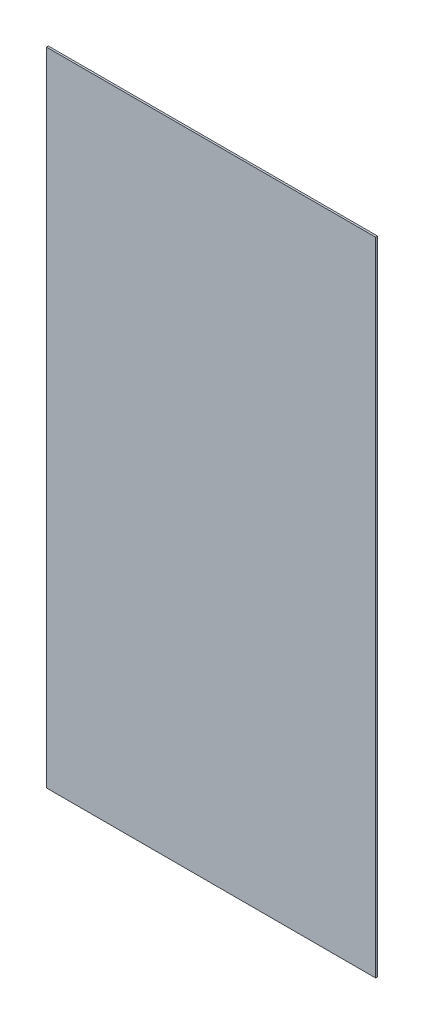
ISO-10303-21;
HEADER;
FILE_DESCRIPTION(('STEP AP214'),'2;1');
FILE_NAME('part.step','',(''),(''),'','','');
FILE_SCHEMA(('AUTOMOTIVE_DESIGN { 1 0 10303 214 1 1 1 1 }'));
ENDSEC;
DATA;
#1=APPLICATION_CONTEXT('core data for automotive mechanical design processes');
#2=APPLICATION_PROTOCOL_DEFINITION('international standard','automotive_design',2000,#1);
#3=PRODUCT_CONTEXT('',#1,'mechanical');
#4=PRODUCT('Part','Part','',(#3));
#5=PRODUCT_RELATED_PRODUCT_CATEGORY('part','',(#4));
#6=PRODUCT_DEFINITION_FORMATION('','',#4);
#7=PRODUCT_DEFINITION_CONTEXT('part definition',#1,'design');
#8=PRODUCT_DEFINITION('design','',#6,#7);
#9=PRODUCT_DEFINITION_SHAPE('','',#8);
#10=(LENGTH_UNIT() NAMED_UNIT(*) SI_UNIT(.MILLI.,.METRE.));
#11=(NAMED_UNIT(*) PLANE_ANGLE_UNIT() SI_UNIT($,.RADIAN.));
#12=(NAMED_UNIT(*) SI_UNIT($,.STERADIAN.) SOLID_ANGLE_UNIT());
#13=UNCERTAINTY_MEASURE_WITH_UNIT(LENGTH_MEASURE(1.E-05),#10,'distance_accuracy_value','');
#14=(GEOMETRIC_REPRESENTATION_CONTEXT(3) GLOBAL_UNCERTAINTY_ASSIGNED_CONTEXT((#13)) GLOBAL_UNIT_ASSIGNED_CONTEXT((#10,
#11,#12)) REPRESENTATION_CONTEXT('',''));
#15=CARTESIAN_POINT('',(0.,0.,0.));
#16=DIRECTION('',(0.,0.,1.));
#17=DIRECTION('',(1.,0.,0.));
#18=AXIS2_PLACEMENT_3D('',#15,#16,#17);
#19=CARTESIAN_POINT('',(0.,1000.,6.));
#20=DIRECTION('',(1.,0.,0.));
#21=DIRECTION('',(0.,0.,-1.));
#22=AXIS2_PLACEMENT_3D('',#19,#20,#21);
#23=PLANE('',#22);
#24=DIRECTION('',(0.,-1.,0.));
#25=VECTOR('',#24,1.);
#26=CARTESIAN_POINT('',(0.,1000.,0.));
#27=LINE('',#26,#25);
#28=CARTESIAN_POINT('',(0.,1000.,0.));
#29=VERTEX_POINT('',#28);
#30=CARTESIAN_POINT('',(0.,-1000.,0.));
#31=VERTEX_POINT('',#30);
#32=EDGE_CURVE('E97',#29,#31,#27,.T.);
#33=ORIENTED_EDGE('',*,*,#32,.T.);
#34=DIRECTION('',(0.,0.,-1.));
#35=VECTOR('',#34,1.);
#36=CARTESIAN_POINT('',(0.,-1000.,6.));
#37=LINE('',#36,#35);
#38=CARTESIAN_POINT('',(0.,-1000.,6.));
#39=VERTEX_POINT('',#38);
#40=EDGE_CURVE('E11',#39,#31,#37,.T.);
#41=ORIENTED_EDGE('',*,*,#40,.F.);
#42=DIRECTION('',(0.,-1.,0.));
#43=VECTOR('',#42,1.);
#44=CARTESIAN_POINT('',(0.,1000.,6.));
#45=LINE('',#44,#43);
#46=CARTESIAN_POINT('',(0.,1000.,6.));
#47=VERTEX_POINT('',#46);
#48=EDGE_CURVE('E85',#47,#39,#45,.T.);
#49=ORIENTED_EDGE('',*,*,#48,.F.);
#50=DIRECTION('',(0.,0.,-1.));
#51=VECTOR('',#50,1.);
#52=CARTESIAN_POINT('',(0.,1000.,6.));
#53=LINE('',#52,#51);
#54=EDGE_CURVE('E93',#47,#29,#53,.T.);
#55=ORIENTED_EDGE('',*,*,#54,.T.);
#56=EDGE_LOOP('',(#33,#41,#49,#55));
#57=FACE_BOUND('',#56,.T.);
#58=ADVANCED_FACE('F34',(#57),#23,.F.);
#59=CARTESIAN_POINT('',(0.,-1000.,6.));
#60=DIRECTION('',(0.,1.,0.));
#61=DIRECTION('',(0.,0.,1.));
#62=AXIS2_PLACEMENT_3D('',#59,#60,#61);
#63=PLANE('',#62);
#64=DIRECTION('',(1.,0.,0.));
#65=VECTOR('',#64,1.);
#66=CARTESIAN_POINT('',(0.,-1000.,0.));
#67=LINE('',#66,#65);
#68=CARTESIAN_POINT('',(1026.,-1000.,0.));
#69=VERTEX_POINT('',#68);
#70=EDGE_CURVE('E89',#31,#69,#67,.T.);
#71=ORIENTED_EDGE('',*,*,#70,.T.);
#72=DIRECTION('',(0.,0.,-1.));
#73=VECTOR('',#72,1.);
#74=CARTESIAN_POINT('',(1026.,-1000.,6.));
#75=LINE('',#74,#73);
#76=CARTESIAN_POINT('',(1026.,-1000.,6.));
#77=VERTEX_POINT('',#76);
#78=EDGE_CURVE('E42',#77,#69,#75,.T.);
#79=ORIENTED_EDGE('',*,*,#78,.F.);
#80=DIRECTION('',(1.,0.,0.));
#81=VECTOR('',#80,1.);
#82=CARTESIAN_POINT('',(0.,-1000.,6.));
#83=LINE('',#82,#81);
#84=EDGE_CURVE('E80',#39,#77,#83,.T.);
#85=ORIENTED_EDGE('',*,*,#84,.F.);
#86=ORIENTED_EDGE('',*,*,#40,.T.);
#87=EDGE_LOOP('',(#71,#79,#85,#86));
#88=FACE_BOUND('',#87,.T.);
#89=ADVANCED_FACE('F88',(#88),#63,.F.);
#90=CARTESIAN_POINT('',(1026.,1000.,6.));
#91=DIRECTION('',(-1.,0.,0.));
#92=DIRECTION('',(0.,0.,1.));
#93=AXIS2_PLACEMENT_3D('',#90,#91,#92);
#94=PLANE('',#93);
#95=DIRECTION('',(0.,1.,0.));
#96=VECTOR('',#95,1.);
#97=CARTESIAN_POINT('',(1026.,1000.,0.));
#98=LINE('',#97,#96);
#99=CARTESIAN_POINT('',(1026.,1000.,0.));
#100=VERTEX_POINT('',#99);
#101=EDGE_CURVE('E67',#69,#100,#98,.T.);
#102=ORIENTED_EDGE('',*,*,#101,.T.);
#103=DIRECTION('',(0.,0.,-1.));
#104=VECTOR('',#103,1.);
#105=CARTESIAN_POINT('',(1026.,1000.,6.));
#106=LINE('',#105,#104);
#107=CARTESIAN_POINT('',(1026.,1000.,6.));
#108=VERTEX_POINT('',#107);
#109=EDGE_CURVE('E90',#108,#100,#106,.T.);
#110=ORIENTED_EDGE('',*,*,#109,.F.);
#111=DIRECTION('',(0.,1.,0.));
#112=VECTOR('',#111,1.);
#113=CARTESIAN_POINT('',(1026.,1000.,6.));
#114=LINE('',#113,#112);
#115=EDGE_CURVE('E83',#77,#108,#114,.T.);
#116=ORIENTED_EDGE('',*,*,#115,.F.);
#117=ORIENTED_EDGE('',*,*,#78,.T.);
#118=EDGE_LOOP('',(#102,#110,#116,#117));
#119=FACE_BOUND('',#118,.T.);
#120=ADVANCED_FACE('F91',(#119),#94,.F.);
#121=CARTESIAN_POINT('',(0.,1000.,6.));
#122=DIRECTION('',(0.,-1.,0.));
#123=DIRECTION('',(0.,0.,-1.));
#124=AXIS2_PLACEMENT_3D('',#121,#122,#123);
#125=PLANE('',#124);
#126=DIRECTION('',(-1.,0.,0.));
#127=VECTOR('',#126,1.);
#128=CARTESIAN_POINT('',(0.,1000.,0.));
#129=LINE('',#128,#127);
#130=EDGE_CURVE('E73',#100,#29,#129,.T.);
#131=ORIENTED_EDGE('',*,*,#130,.T.);
#132=ORIENTED_EDGE('',*,*,#54,.F.);
#133=DIRECTION('',(-1.,0.,0.));
#134=VECTOR('',#133,1.);
#135=CARTESIAN_POINT('',(0.,1000.,6.));
#136=LINE('',#135,#134);
#137=EDGE_CURVE('E50',#108,#47,#136,.T.);
#138=ORIENTED_EDGE('',*,*,#137,.F.);
#139=ORIENTED_EDGE('',*,*,#109,.T.);
#140=EDGE_LOOP('',(#131,#132,#138,#139));
#141=FACE_BOUND('',#140,.T.);
#142=ADVANCED_FACE('F104',(#141),#125,.F.);
#143=CARTESIAN_POINT('',(0.,0.,6.));
#144=DIRECTION('',(0.,0.,1.));
#145=DIRECTION('',(1.,0.,0.));
#146=AXIS2_PLACEMENT_3D('',#143,#144,#145);
#147=PLANE('',#146);
#148=ORIENTED_EDGE('',*,*,#48,.T.);
#149=ORIENTED_EDGE('',*,*,#84,.T.);
#150=ORIENTED_EDGE('',*,*,#115,.T.);
#151=ORIENTED_EDGE('',*,*,#137,.T.);
#152=EDGE_LOOP('',(#148,#149,#150,#151));
#153=FACE_BOUND('',#152,.T.);
#154=ADVANCED_FACE('F81',(#153),#147,.T.);
#155=CARTESIAN_POINT('',(0.,0.,0.));
#156=DIRECTION('',(0.,0.,1.));
#157=DIRECTION('',(1.,0.,0.));
#158=AXIS2_PLACEMENT_3D('',#155,#156,#157);
#159=PLANE('',#158);
#160=ORIENTED_EDGE('',*,*,#32,.F.);
#161=ORIENTED_EDGE('',*,*,#130,.F.);
#162=ORIENTED_EDGE('',*,*,#101,.F.);
#163=ORIENTED_EDGE('',*,*,#70,.F.);
#164=EDGE_LOOP('',(#160,#161,#162,#163));
#165=FACE_BOUND('',#164,.T.);
#166=ADVANCED_FACE('F107',(#165),#159,.F.);
#167=CLOSED_SHELL('',(#58,#89,#120,#142,#154,#166));
#168=MANIFOLD_SOLID_BREP('B2',#167);
#169=ADVANCED_BREP_SHAPE_REPRESENTATION('',(#18,#168),#14);
#170=SHAPE_DEFINITION_REPRESENTATION(#9,#169);
ENDSEC;
END-ISO-10303-21;
